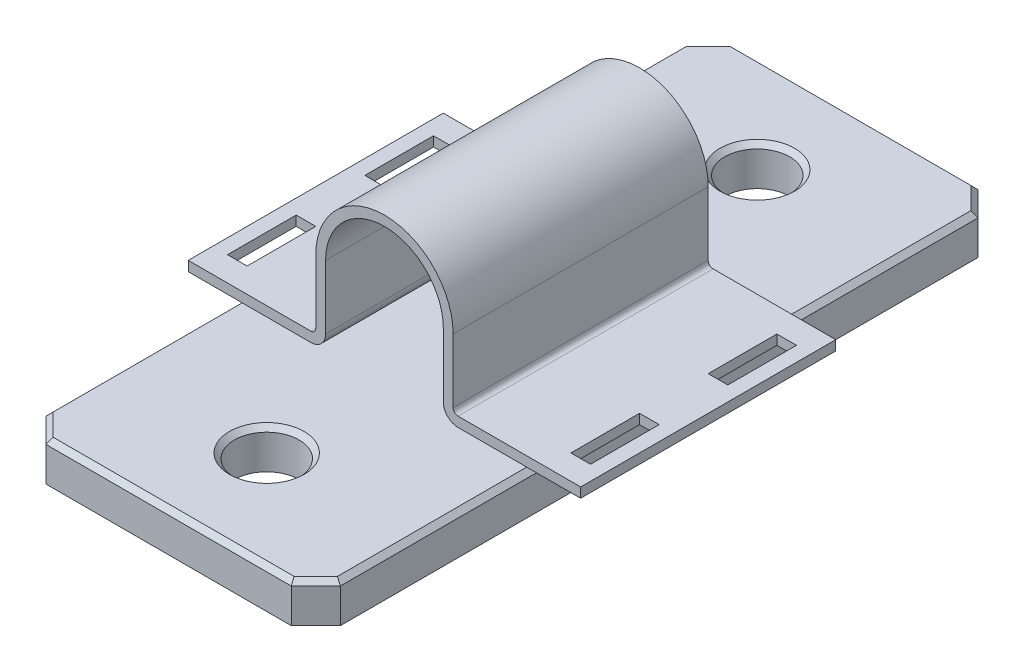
from build123d import *

# Parameters (mm, degrees)
SKETCH4_W            = 30
SKETCH4_H            = 70
BOSS_EXTRUDE2_DEPTH  = 4
M6_CLEARANCE_HOLE1_D = 6.6
CHAMFER2_SIZE        = 2.5
CHAMFER3_SIZE        = 0.5
EXTRUDE_THIN1_DEPTH  = 13
CUT_EXTRUDE1_REACH   = 44.673
SKETCH10_W           = 2
SKETCH10_H           = 7


with BuildPart() as part:
    # Sketch4 → Boss-Extrude2 (new body)
    with BuildSketch(Plane(origin=(0, 0, 0), x_dir=(1, 0, 0), z_dir=(0, 1, 0))):
        Rectangle(SKETCH4_W, SKETCH4_H)
    extrude(amount=BOSS_EXTRUDE2_DEPTH)

    # M6 Clearance Hole1 (through all)
    with Locations(Plane(origin=(0, 4, 0), x_dir=(1, 0, 0), z_dir=(0, 1, 0))):
        with Locations((0, -25), (0, 25)):
            Hole(M6_CLEARANCE_HOLE1_D / 2)

    # Chamfer2
    chamfer2_edges = [part.edges().sort_by_distance(p)[0] for p in [
        (-15, 2, -35),
        (15, 2, -35),
        (15, 2, 35),
        (-15, 2, 35),
    ]]
    chamfer(chamfer2_edges, length=CHAMFER2_SIZE)

    # Chamfer3
    chamfer3_edges = [part.edges().sort_by_distance(p)[0] for p in [
        (3.3, 4, -25),
        (3.3, 4, 25),
        (0, 4, -35),
        (15, 4, 0),
        (-15, 4, 0),
        (0, 4, 35),
        (13.75, 4, 33.75),
        (-13.75, 4, 33.75),
        (-13.75, 4, -33.75),
        (13.75, 4, -33.75),
    ]]
    chamfer(chamfer3_edges, length=CHAMFER3_SIZE)

    # Sketch9 → Extrude-Thin1 (add, symmetric)
    with BuildSketch(Plane.XY):
        with BuildLine():
            Line((-20, 4), (-7.5, 4))
            ThreePointArc((-7.5, 4), (-6.439339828, 4.439339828), (-6, 5.5))
            Line((-6, 5.5), (-6, 12))
            ThreePointArc((-6, 12), (0, 18), (6, 12))
            Line((6, 12), (6, 5.5))
            ThreePointArc((6, 5.5), (6.439339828, 4.439339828), (7.5, 4))
            Line((7.5, 4), (20, 4))
            Line((20, 4), (20, 5))
            Line((20, 5), (7.5, 5))
            ThreePointArc((7.5, 5), (7.146446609, 5.146446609), (7, 5.5))
            Line((7, 5.5), (7, 12))
            ThreePointArc((7, 12), (0, 19), (-7, 12))
            Line((-7, 12), (-7, 5.5))
            ThreePointArc((-7, 5.5), (-7.146446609, 5.146446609), (-7.5, 5))
            Line((-7.5, 5), (-20, 5))
            Line((-20, 5), (-20, 4))
        make_face()
    extrude(amount=EXTRUDE_THIN1_DEPTH, both=True)

    # Sketch10 → Cut-Extrude1 (cut, up to next)
    with BuildSketch(Plane(origin=(0, 5, 0), x_dir=(1, 0, 0), z_dir=(0, 1, 0)), mode=Mode.PRIVATE) as cut_extrude1_sk1:
        with Locations((17.5, -7)):
            Rectangle(SKETCH10_W, SKETCH10_H)
    cut_extrude1_tool1 = extrude(cut_extrude1_sk1.sketch, amount=-CUT_EXTRUDE1_REACH, mode=Mode.PRIVATE) & part.part
    # Sketch10 → Cut-Extrude1 (cut, up to next)
    with BuildSketch(Plane(origin=(0, 5, 0), x_dir=(1, 0, 0), z_dir=(0, 1, 0)), mode=Mode.PRIVATE) as cut_extrude1_sk2:
        with Locations((17.5, 7)):
            Rectangle(SKETCH10_W, SKETCH10_H)
    cut_extrude1_tool2 = extrude(cut_extrude1_sk2.sketch, amount=-CUT_EXTRUDE1_REACH, mode=Mode.PRIVATE) & part.part
    cut_extrude1_1 = cut_extrude1_tool1.solids().sort_by_distance((17.5, 5, 7))[0]
    add(cut_extrude1_1, mode=Mode.SUBTRACT)
    cut_extrude1_2 = cut_extrude1_tool2.solids().sort_by_distance((17.5, 5, -7))[0]
    add(cut_extrude1_2, mode=Mode.SUBTRACT)
    cut_extrude1 = cut_extrude1_1 + cut_extrude1_2  # Cut-Extrude1 as one shape, for the pattern or mirror that repeats it

    # Mirror1: Cut-Extrude1 across plane
    add(cut_extrude1.mirror(Plane(origin=(0, 0, 0), x_dir=(0, 0, 1), z_dir=(1, 0, 0))), mode=Mode.SUBTRACT)


solid = part.part
